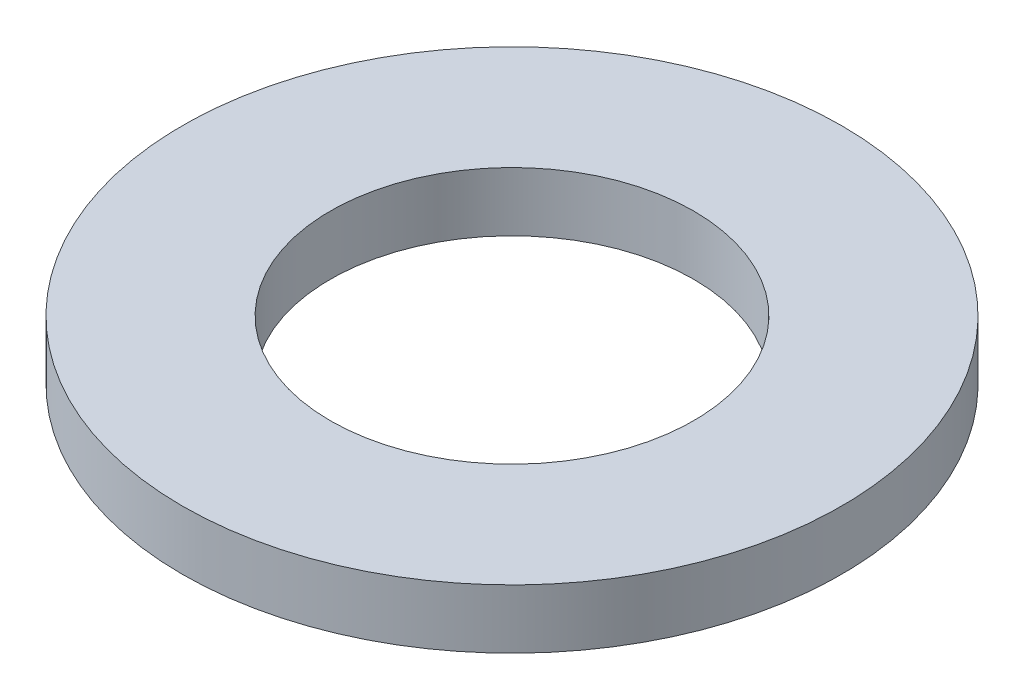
ISO-10303-21;
HEADER;
FILE_DESCRIPTION(('STEP AP214'),'2;1');
FILE_NAME('part.step','',(''),(''),'','','');
FILE_SCHEMA(('AUTOMOTIVE_DESIGN { 1 0 10303 214 1 1 1 1 }'));
ENDSEC;
DATA;
#1=APPLICATION_CONTEXT('core data for automotive mechanical design processes');
#2=APPLICATION_PROTOCOL_DEFINITION('international standard','automotive_design',2000,#1);
#3=PRODUCT_CONTEXT('',#1,'mechanical');
#4=PRODUCT('Part','Part','',(#3));
#5=PRODUCT_RELATED_PRODUCT_CATEGORY('part','',(#4));
#6=PRODUCT_DEFINITION_FORMATION('','',#4);
#7=PRODUCT_DEFINITION_CONTEXT('part definition',#1,'design');
#8=PRODUCT_DEFINITION('design','',#6,#7);
#9=PRODUCT_DEFINITION_SHAPE('','',#8);
#10=(LENGTH_UNIT() NAMED_UNIT(*) SI_UNIT(.MILLI.,.METRE.));
#11=(NAMED_UNIT(*) PLANE_ANGLE_UNIT() SI_UNIT($,.RADIAN.));
#12=(NAMED_UNIT(*) SI_UNIT($,.STERADIAN.) SOLID_ANGLE_UNIT());
#13=UNCERTAINTY_MEASURE_WITH_UNIT(LENGTH_MEASURE(1.E-05),#10,'distance_accuracy_value','');
#14=(GEOMETRIC_REPRESENTATION_CONTEXT(3) GLOBAL_UNCERTAINTY_ASSIGNED_CONTEXT((#13)) GLOBAL_UNIT_ASSIGNED_CONTEXT((#10,
#11,#12)) REPRESENTATION_CONTEXT('',''));
#15=CARTESIAN_POINT('',(0.,0.,0.));
#16=DIRECTION('',(0.,0.,1.));
#17=DIRECTION('',(1.,0.,0.));
#18=AXIS2_PLACEMENT_3D('',#15,#16,#17);
#19=CARTESIAN_POINT('',(0.,7.,0.));
#20=DIRECTION('',(0.,1.,0.));
#21=DIRECTION('',(0.,0.,1.));
#22=AXIS2_PLACEMENT_3D('',#19,#20,#21);
#23=PLANE('',#22);
#24=CARTESIAN_POINT('',(0.,7.,0.));
#25=DIRECTION('',(0.,1.,0.));
#26=DIRECTION('',(0.,0.,1.));
#27=AXIS2_PLACEMENT_3D('',#24,#25,#26);
#28=CIRCLE('',#27,39.);
#29=CARTESIAN_POINT('',(0.,7.,39.));
#30=VERTEX_POINT('',#29);
#31=EDGE_CURVE('E10',#30,#30,#28,.T.);
#32=ORIENTED_EDGE('',*,*,#31,.T.);
#33=EDGE_LOOP('',(#32));
#34=FACE_BOUND('',#33,.T.);
#35=CARTESIAN_POINT('',(0.,7.,0.));
#36=DIRECTION('',(0.,1.,0.));
#37=DIRECTION('',(0.,0.,1.));
#38=AXIS2_PLACEMENT_3D('',#35,#36,#37);
#39=CIRCLE('',#38,21.5);
#40=CARTESIAN_POINT('',(0.,7.,21.5));
#41=VERTEX_POINT('',#40);
#42=EDGE_CURVE('E39',#41,#41,#39,.T.);
#43=ORIENTED_EDGE('',*,*,#42,.F.);
#44=EDGE_LOOP('',(#43));
#45=FACE_BOUND('',#44,.T.);
#46=ADVANCED_FACE('F28',(#34,#45),#23,.T.);
#47=CARTESIAN_POINT('',(0.,0.,0.));
#48=DIRECTION('',(0.,1.,0.));
#49=DIRECTION('',(0.,0.,1.));
#50=AXIS2_PLACEMENT_3D('',#47,#48,#49);
#51=PLANE('',#50);
#52=CARTESIAN_POINT('',(0.,0.,0.));
#53=DIRECTION('',(0.,1.,0.));
#54=DIRECTION('',(0.,0.,1.));
#55=AXIS2_PLACEMENT_3D('',#52,#53,#54);
#56=CIRCLE('',#55,39.);
#57=CARTESIAN_POINT('',(0.,0.,39.));
#58=VERTEX_POINT('',#57);
#59=EDGE_CURVE('E35',#58,#58,#56,.T.);
#60=ORIENTED_EDGE('',*,*,#59,.F.);
#61=EDGE_LOOP('',(#60));
#62=FACE_BOUND('',#61,.T.);
#63=CARTESIAN_POINT('',(0.,0.,0.));
#64=DIRECTION('',(0.,1.,0.));
#65=DIRECTION('',(0.,0.,1.));
#66=AXIS2_PLACEMENT_3D('',#63,#64,#65);
#67=CIRCLE('',#66,21.5);
#68=CARTESIAN_POINT('',(0.,0.,21.5));
#69=VERTEX_POINT('',#68);
#70=EDGE_CURVE('E43',#69,#69,#67,.T.);
#71=ORIENTED_EDGE('',*,*,#70,.T.);
#72=EDGE_LOOP('',(#71));
#73=FACE_BOUND('',#72,.T.);
#74=ADVANCED_FACE('F49',(#62,#73),#51,.F.);
#75=CARTESIAN_POINT('',(0.,7.,0.));
#76=DIRECTION('',(0.,-1.,0.));
#77=DIRECTION('',(0.,0.,-1.));
#78=AXIS2_PLACEMENT_3D('',#75,#76,#77);
#79=CYLINDRICAL_SURFACE('',#78,39.);
#80=ORIENTED_EDGE('',*,*,#31,.F.);
#81=EDGE_LOOP('',(#80));
#82=FACE_BOUND('',#81,.T.);
#83=ORIENTED_EDGE('',*,*,#59,.T.);
#84=EDGE_LOOP('',(#83));
#85=FACE_BOUND('',#84,.T.);
#86=ADVANCED_FACE('F30',(#82,#85),#79,.T.);
#87=CARTESIAN_POINT('',(0.,7.,0.));
#88=DIRECTION('',(0.,-1.,0.));
#89=DIRECTION('',(0.,0.,-1.));
#90=AXIS2_PLACEMENT_3D('',#87,#88,#89);
#91=CYLINDRICAL_SURFACE('',#90,21.5);
#92=ORIENTED_EDGE('',*,*,#42,.T.);
#93=EDGE_LOOP('',(#92));
#94=FACE_BOUND('',#93,.T.);
#95=ORIENTED_EDGE('',*,*,#70,.F.);
#96=EDGE_LOOP('',(#95));
#97=FACE_BOUND('',#96,.T.);
#98=ADVANCED_FACE('F51',(#94,#97),#91,.F.);
#99=CLOSED_SHELL('',(#46,#74,#86,#98));
#100=MANIFOLD_SOLID_BREP('B2',#99);
#101=ADVANCED_BREP_SHAPE_REPRESENTATION('',(#18,#100),#14);
#102=SHAPE_DEFINITION_REPRESENTATION(#9,#101);
ENDSEC;
END-ISO-10303-21;
